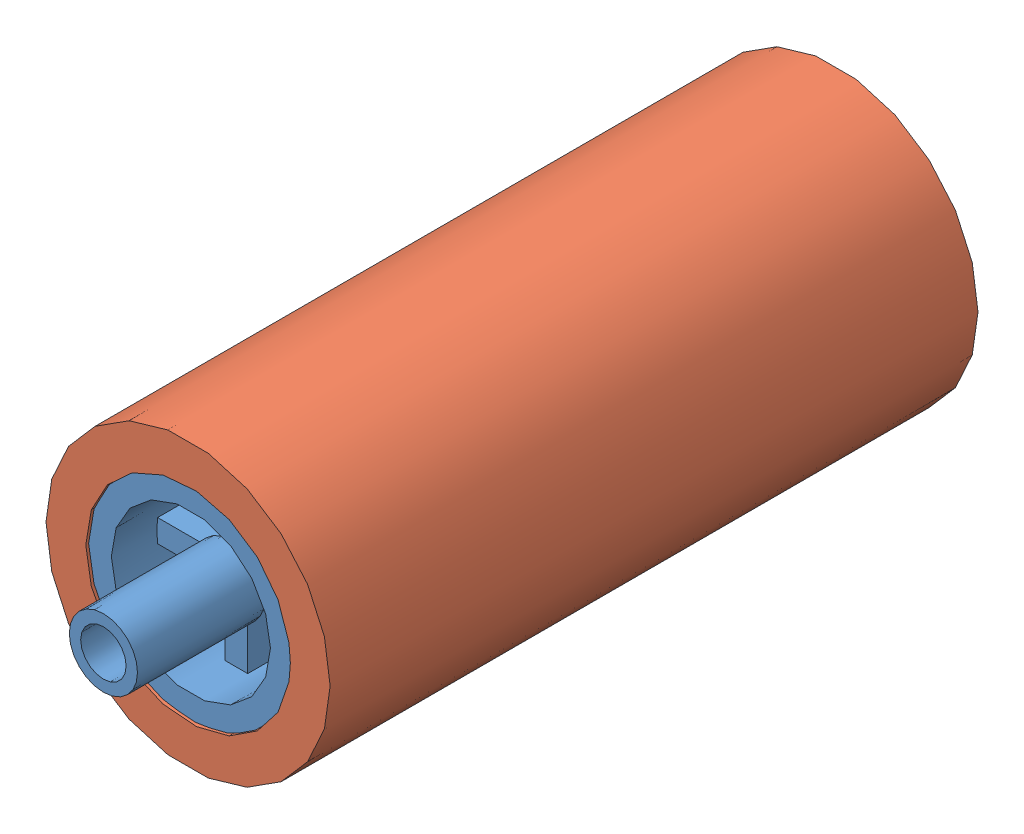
SolidWorks assembly Galet entrainement.SLDASM, configuration Défaut (file format 3400). Lengths in mm.
Overall size (25 25 68.75).
2 component instances, 2 part files, 2 mates.
Components (placement in the parent):
- Galet entrainement-1: Galet entrainement.SLDPRT [Défaut] at origin size (18 18 68.75)
- Anneau galet-1: Anneau galet.SLDPRT [Défaut] at origin size (25 25 57)
Mates (geometry in assembly coordinates):
- Coaxiale1: concentric aligned: cylinder of ?; cylinder of ?
- Coïncidente1: coincident aligned: plane of ? through (0 0 0) normal (0 0 1); plane of ? through (0 0 0) normal (0 0 1)
